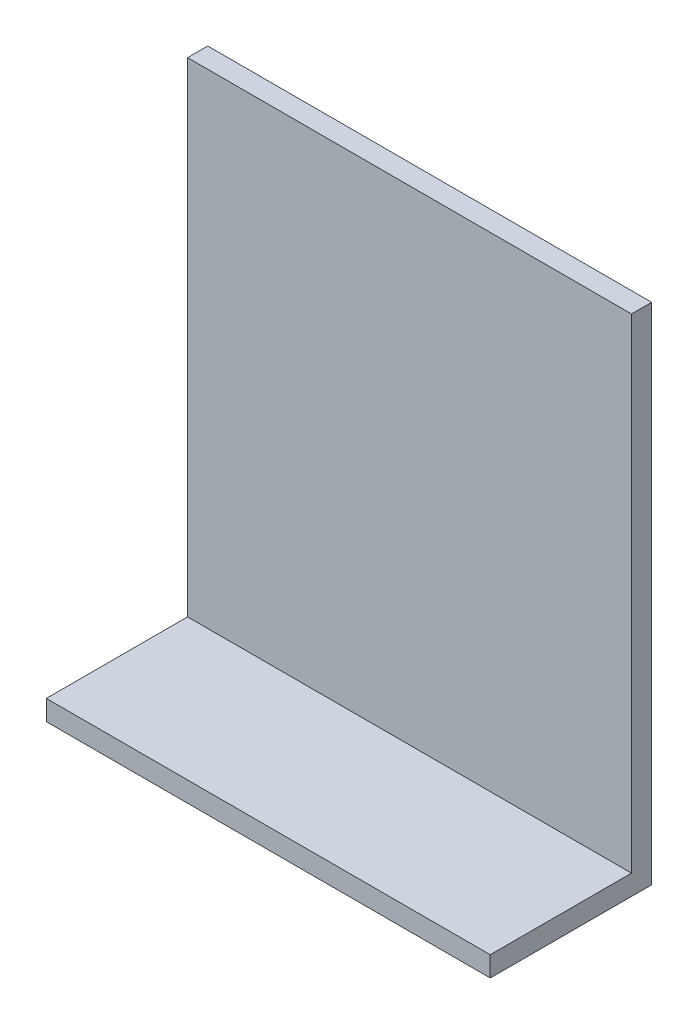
ISO-10303-21;
HEADER;
FILE_DESCRIPTION(('STEP AP214'),'2;1');
FILE_NAME('part.step','',(''),(''),'','','');
FILE_SCHEMA(('AUTOMOTIVE_DESIGN { 1 0 10303 214 1 1 1 1 }'));
ENDSEC;
DATA;
#1=APPLICATION_CONTEXT('core data for automotive mechanical design processes');
#2=APPLICATION_PROTOCOL_DEFINITION('international standard','automotive_design',2000,#1);
#3=PRODUCT_CONTEXT('',#1,'mechanical');
#4=PRODUCT('Part','Part','',(#3));
#5=PRODUCT_RELATED_PRODUCT_CATEGORY('part','',(#4));
#6=PRODUCT_DEFINITION_FORMATION('','',#4);
#7=PRODUCT_DEFINITION_CONTEXT('part definition',#1,'design');
#8=PRODUCT_DEFINITION('design','',#6,#7);
#9=PRODUCT_DEFINITION_SHAPE('','',#8);
#10=(LENGTH_UNIT() NAMED_UNIT(*) SI_UNIT(.MILLI.,.METRE.));
#11=(NAMED_UNIT(*) PLANE_ANGLE_UNIT() SI_UNIT($,.RADIAN.));
#12=(NAMED_UNIT(*) SI_UNIT($,.STERADIAN.) SOLID_ANGLE_UNIT());
#13=UNCERTAINTY_MEASURE_WITH_UNIT(LENGTH_MEASURE(1.E-05),#10,'distance_accuracy_value','');
#14=(GEOMETRIC_REPRESENTATION_CONTEXT(3) GLOBAL_UNCERTAINTY_ASSIGNED_CONTEXT((#13)) GLOBAL_UNIT_ASSIGNED_CONTEXT((#10,
#11,#12)) REPRESENTATION_CONTEXT('',''));
#15=CARTESIAN_POINT('',(0.,0.,0.));
#16=DIRECTION('',(0.,0.,1.));
#17=DIRECTION('',(1.,0.,0.));
#18=AXIS2_PLACEMENT_3D('',#15,#16,#17);
#19=CARTESIAN_POINT('',(44.,0.,32.));
#20=DIRECTION('',(0.,1.,0.));
#21=DIRECTION('',(0.,0.,1.));
#22=AXIS2_PLACEMENT_3D('',#19,#20,#21);
#23=PLANE('',#22);
#24=DIRECTION('',(-1.,0.,0.));
#25=VECTOR('',#24,1.);
#26=CARTESIAN_POINT('',(44.,0.,32.));
#27=LINE('',#26,#25);
#28=CARTESIAN_POINT('',(44.,0.,32.));
#29=VERTEX_POINT('',#28);
#30=CARTESIAN_POINT('',(-44.,0.,32.));
#31=VERTEX_POINT('',#30);
#32=EDGE_CURVE('E96',#29,#31,#27,.T.);
#33=ORIENTED_EDGE('',*,*,#32,.T.);
#34=DIRECTION('',(0.,0.,-1.));
#35=VECTOR('',#34,1.);
#36=CARTESIAN_POINT('',(-44.,0.,32.));
#37=LINE('',#36,#35);
#38=CARTESIAN_POINT('',(-44.,0.,0.));
#39=VERTEX_POINT('',#38);
#40=EDGE_CURVE('E90',#31,#39,#37,.T.);
#41=ORIENTED_EDGE('',*,*,#40,.T.);
#42=DIRECTION('',(-1.,0.,0.));
#43=VECTOR('',#42,1.);
#44=CARTESIAN_POINT('',(44.,0.,0.));
#45=LINE('',#44,#43);
#46=CARTESIAN_POINT('',(44.,0.,0.));
#47=VERTEX_POINT('',#46);
#48=EDGE_CURVE('E11',#47,#39,#45,.T.);
#49=ORIENTED_EDGE('',*,*,#48,.F.);
#50=DIRECTION('',(0.,0.,-1.));
#51=VECTOR('',#50,1.);
#52=CARTESIAN_POINT('',(44.,0.,32.));
#53=LINE('',#52,#51);
#54=EDGE_CURVE('E108',#29,#47,#53,.T.);
#55=ORIENTED_EDGE('',*,*,#54,.F.);
#56=EDGE_LOOP('',(#33,#41,#49,#55));
#57=FACE_BOUND('',#56,.T.);
#58=ADVANCED_FACE('F26',(#57),#23,.F.);
#59=CARTESIAN_POINT('',(44.,0.,0.));
#60=DIRECTION('',(0.,0.,1.));
#61=DIRECTION('',(1.,0.,0.));
#62=AXIS2_PLACEMENT_3D('',#59,#60,#61);
#63=PLANE('',#62);
#64=ORIENTED_EDGE('',*,*,#48,.T.);
#65=DIRECTION('',(0.,1.,0.));
#66=VECTOR('',#65,1.);
#67=CARTESIAN_POINT('',(-44.,0.,0.));
#68=LINE('',#67,#66);
#69=CARTESIAN_POINT('',(-44.,100.,0.));
#70=VERTEX_POINT('',#69);
#71=EDGE_CURVE('E80',#39,#70,#68,.T.);
#72=ORIENTED_EDGE('',*,*,#71,.T.);
#73=DIRECTION('',(-1.,0.,0.));
#74=VECTOR('',#73,1.);
#75=CARTESIAN_POINT('',(44.,100.,0.));
#76=LINE('',#75,#74);
#77=CARTESIAN_POINT('',(44.,100.,0.));
#78=VERTEX_POINT('',#77);
#79=EDGE_CURVE('E33',#78,#70,#76,.T.);
#80=ORIENTED_EDGE('',*,*,#79,.F.);
#81=DIRECTION('',(0.,1.,0.));
#82=VECTOR('',#81,1.);
#83=CARTESIAN_POINT('',(44.,0.,0.));
#84=LINE('',#83,#82);
#85=EDGE_CURVE('E81',#47,#78,#84,.T.);
#86=ORIENTED_EDGE('',*,*,#85,.F.);
#87=EDGE_LOOP('',(#64,#72,#80,#86));
#88=FACE_BOUND('',#87,.T.);
#89=ADVANCED_FACE('F78',(#88),#63,.F.);
#90=CARTESIAN_POINT('',(44.,100.,0.));
#91=DIRECTION('',(0.,-1.,0.));
#92=DIRECTION('',(0.,0.,-1.));
#93=AXIS2_PLACEMENT_3D('',#90,#91,#92);
#94=PLANE('',#93);
#95=ORIENTED_EDGE('',*,*,#79,.T.);
#96=DIRECTION('',(0.,0.,1.));
#97=VECTOR('',#96,1.);
#98=CARTESIAN_POINT('',(-44.,100.,0.));
#99=LINE('',#98,#97);
#100=CARTESIAN_POINT('',(-44.,100.,4.));
#101=VERTEX_POINT('',#100);
#102=EDGE_CURVE('E94',#70,#101,#99,.T.);
#103=ORIENTED_EDGE('',*,*,#102,.T.);
#104=DIRECTION('',(-1.,0.,0.));
#105=VECTOR('',#104,1.);
#106=CARTESIAN_POINT('',(44.,100.,4.));
#107=LINE('',#106,#105);
#108=CARTESIAN_POINT('',(44.,100.,4.));
#109=VERTEX_POINT('',#108);
#110=EDGE_CURVE('E122',#109,#101,#107,.T.);
#111=ORIENTED_EDGE('',*,*,#110,.F.);
#112=DIRECTION('',(0.,0.,1.));
#113=VECTOR('',#112,1.);
#114=CARTESIAN_POINT('',(44.,100.,0.));
#115=LINE('',#114,#113);
#116=EDGE_CURVE('E111',#78,#109,#115,.T.);
#117=ORIENTED_EDGE('',*,*,#116,.F.);
#118=EDGE_LOOP('',(#95,#103,#111,#117));
#119=FACE_BOUND('',#118,.T.);
#120=ADVANCED_FACE('F125',(#119),#94,.F.);
#121=CARTESIAN_POINT('',(44.,100.,4.));
#122=DIRECTION('',(0.,0.,-1.));
#123=DIRECTION('',(0.,1.,0.));
#124=AXIS2_PLACEMENT_3D('',#121,#122,#123);
#125=PLANE('',#124);
#126=ORIENTED_EDGE('',*,*,#110,.T.);
#127=DIRECTION('',(0.,-1.,0.));
#128=VECTOR('',#127,1.);
#129=CARTESIAN_POINT('',(-44.,100.,4.));
#130=LINE('',#129,#128);
#131=CARTESIAN_POINT('',(-44.,4.,3.99999999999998));
#132=VERTEX_POINT('',#131);
#133=EDGE_CURVE('E100',#101,#132,#130,.T.);
#134=ORIENTED_EDGE('',*,*,#133,.T.);
#135=DIRECTION('',(-1.,0.,0.));
#136=VECTOR('',#135,1.);
#137=CARTESIAN_POINT('',(44.,4.,3.99999999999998));
#138=LINE('',#137,#136);
#139=CARTESIAN_POINT('',(44.,4.,3.99999999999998));
#140=VERTEX_POINT('',#139);
#141=EDGE_CURVE('E120',#140,#132,#138,.T.);
#142=ORIENTED_EDGE('',*,*,#141,.F.);
#143=DIRECTION('',(0.,-1.,0.));
#144=VECTOR('',#143,1.);
#145=CARTESIAN_POINT('',(44.,100.,4.));
#146=LINE('',#145,#144);
#147=EDGE_CURVE('E113',#109,#140,#146,.T.);
#148=ORIENTED_EDGE('',*,*,#147,.F.);
#149=EDGE_LOOP('',(#126,#134,#142,#148));
#150=FACE_BOUND('',#149,.T.);
#151=ADVANCED_FACE('F131',(#150),#125,.F.);
#152=CARTESIAN_POINT('',(44.,4.,3.99999999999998));
#153=DIRECTION('',(0.,-1.,0.));
#154=DIRECTION('',(0.,0.,-1.));
#155=AXIS2_PLACEMENT_3D('',#152,#153,#154);
#156=PLANE('',#155);
#157=ORIENTED_EDGE('',*,*,#141,.T.);
#158=DIRECTION('',(0.,0.,1.));
#159=VECTOR('',#158,1.);
#160=CARTESIAN_POINT('',(-44.,4.,3.99999999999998));
#161=LINE('',#160,#159);
#162=CARTESIAN_POINT('',(-44.,4.,32.));
#163=VERTEX_POINT('',#162);
#164=EDGE_CURVE('E103',#132,#163,#161,.T.);
#165=ORIENTED_EDGE('',*,*,#164,.T.);
#166=DIRECTION('',(-1.,0.,0.));
#167=VECTOR('',#166,1.);
#168=CARTESIAN_POINT('',(44.,4.,32.));
#169=LINE('',#168,#167);
#170=CARTESIAN_POINT('',(44.,4.,32.));
#171=VERTEX_POINT('',#170);
#172=EDGE_CURVE('E118',#171,#163,#169,.T.);
#173=ORIENTED_EDGE('',*,*,#172,.F.);
#174=DIRECTION('',(0.,0.,1.));
#175=VECTOR('',#174,1.);
#176=CARTESIAN_POINT('',(44.,4.,3.99999999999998));
#177=LINE('',#176,#175);
#178=EDGE_CURVE('E45',#140,#171,#177,.T.);
#179=ORIENTED_EDGE('',*,*,#178,.F.);
#180=EDGE_LOOP('',(#157,#165,#173,#179));
#181=FACE_BOUND('',#180,.T.);
#182=ADVANCED_FACE('F134',(#181),#156,.F.);
#183=CARTESIAN_POINT('',(44.,4.,32.));
#184=DIRECTION('',(0.,0.,-1.));
#185=DIRECTION('',(-1.,0.,0.));
#186=AXIS2_PLACEMENT_3D('',#183,#184,#185);
#187=PLANE('',#186);
#188=ORIENTED_EDGE('',*,*,#172,.T.);
#189=DIRECTION('',(0.,-1.,0.));
#190=VECTOR('',#189,1.);
#191=CARTESIAN_POINT('',(-44.,4.,32.));
#192=LINE('',#191,#190);
#193=EDGE_CURVE('E106',#163,#31,#192,.T.);
#194=ORIENTED_EDGE('',*,*,#193,.T.);
#195=ORIENTED_EDGE('',*,*,#32,.F.);
#196=DIRECTION('',(0.,-1.,0.));
#197=VECTOR('',#196,1.);
#198=CARTESIAN_POINT('',(44.,4.,32.));
#199=LINE('',#198,#197);
#200=EDGE_CURVE('E40',#171,#29,#199,.T.);
#201=ORIENTED_EDGE('',*,*,#200,.F.);
#202=EDGE_LOOP('',(#188,#194,#195,#201));
#203=FACE_BOUND('',#202,.T.);
#204=ADVANCED_FACE('F136',(#203),#187,.F.);
#205=CARTESIAN_POINT('',(44.,0.,0.));
#206=DIRECTION('',(1.,0.,0.));
#207=DIRECTION('',(0.,0.,-1.));
#208=AXIS2_PLACEMENT_3D('',#205,#206,#207);
#209=PLANE('',#208);
#210=ORIENTED_EDGE('',*,*,#54,.T.);
#211=ORIENTED_EDGE('',*,*,#85,.T.);
#212=ORIENTED_EDGE('',*,*,#116,.T.);
#213=ORIENTED_EDGE('',*,*,#147,.T.);
#214=ORIENTED_EDGE('',*,*,#178,.T.);
#215=ORIENTED_EDGE('',*,*,#200,.T.);
#216=EDGE_LOOP('',(#210,#211,#212,#213,#214,#215));
#217=FACE_BOUND('',#216,.T.);
#218=ADVANCED_FACE('F128',(#217),#209,.T.);
#219=CARTESIAN_POINT('',(-44.,0.,0.));
#220=DIRECTION('',(1.,0.,0.));
#221=DIRECTION('',(0.,0.,-1.));
#222=AXIS2_PLACEMENT_3D('',#219,#220,#221);
#223=PLANE('',#222);
#224=ORIENTED_EDGE('',*,*,#40,.F.);
#225=ORIENTED_EDGE('',*,*,#193,.F.);
#226=ORIENTED_EDGE('',*,*,#164,.F.);
#227=ORIENTED_EDGE('',*,*,#133,.F.);
#228=ORIENTED_EDGE('',*,*,#102,.F.);
#229=ORIENTED_EDGE('',*,*,#71,.F.);
#230=EDGE_LOOP('',(#224,#225,#226,#227,#228,#229));
#231=FACE_BOUND('',#230,.T.);
#232=ADVANCED_FACE('F88',(#231),#223,.F.);
#233=CLOSED_SHELL('',(#58,#89,#120,#151,#182,#204,#218,#232));
#234=MANIFOLD_SOLID_BREP('B2',#233);
#235=ADVANCED_BREP_SHAPE_REPRESENTATION('',(#18,#234),#14);
#236=SHAPE_DEFINITION_REPRESENTATION(#9,#235);
ENDSEC;
END-ISO-10303-21;
